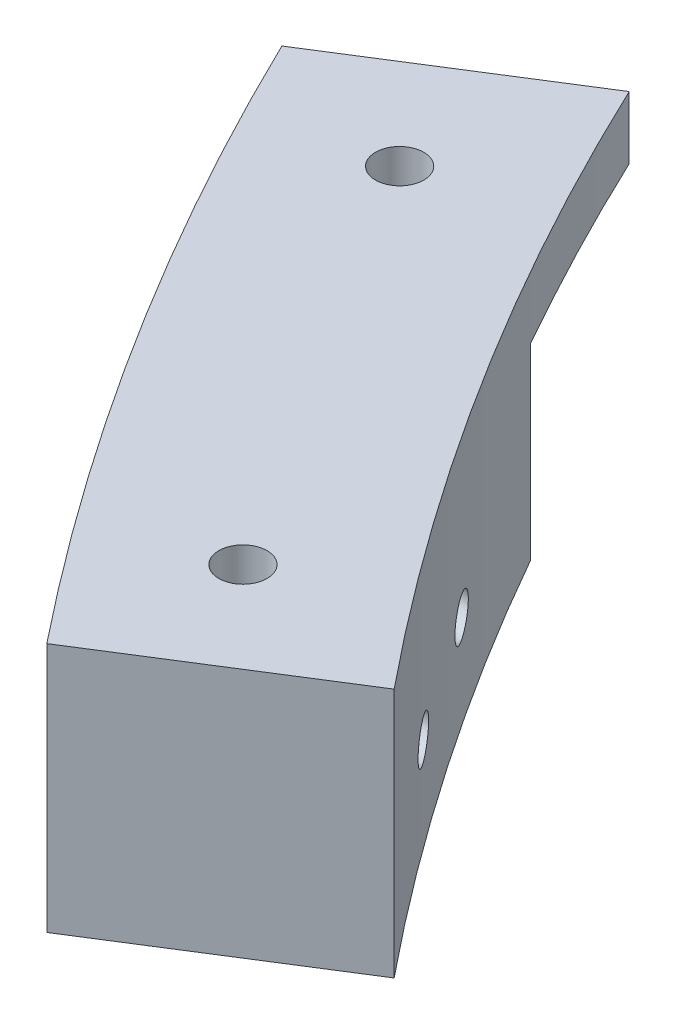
from build123d import *

# Parameters (mm, degrees)
BOSS_EXTRUDE1_DEPTH     = 50.8
CUT_EXTRUDE1_DEPTH      = 38.1
F_3_8_CLEARANCE_HOLE1_D = 9.8044
F_3_8_CLEARANCE_HOLE2_D = 9.8044
F_3_8_16_TAPPED_HOLE1_D = 7.9375
F_3_8_16_TAPPED_HOLE2_D = 7.9375


with BuildPart() as part:
    # Sketch1 → Boss-Extrude1 (new body)
    with BuildSketch(Plane.XZ.offset(80.9625)):
        with BuildLine():
            Line((-617.309061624, 298.749330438), (-574.034978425, 271.493726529))
            ThreePointArc((-574.034978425, 271.493726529), (-537.307692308, 338.416080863), (-492.815119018, 400.447572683))
            Line((-492.815119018, 400.447572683), (-536.089202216, 427.703176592))
            ThreePointArc((-536.089202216, 427.703176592), (-580.292307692, 365.489367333), (-617.309061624, 298.749330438))
        make_face()
    extrude(amount=-BOSS_EXTRUDE1_DEPTH)

    # Sketch2 → Cut-Extrude1 (cut)
    with BuildSketch(Plane.XZ.offset(80.9625)):
        with BuildLine():
            Line((-552.45, 313.087843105), (-552.45, 406.350387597))
            ThreePointArc((-552.45, 406.350387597), (-587.348757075, 354.038243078), (-617.309061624, 298.749330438))
            Line((-617.309061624, 298.749330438), (-574.034978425, 271.493726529))
            ThreePointArc((-574.034978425, 271.493726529), (-563.626311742, 292.489966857), (-552.45, 313.087843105))
        make_face()
    extrude(amount=-CUT_EXTRUDE1_DEPTH, mode=Mode.SUBTRACT)

    # 3_8 Clearance Hole1 (through all)
    with Locations(Plane(origin=(0, -80.9625, 0), x_dir=(-1, 0, 0), z_dir=(0, -1, 0))):
        with Locations((530.071006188, -393.894514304)):
            Hole(F_3_8_CLEARANCE_HOLE1_D / 2)

    # 3_8 Clearance Hole2 (through all)
    with Locations(Plane(origin=(0, -30.1625, 0), x_dir=(1, 0, 0), z_dir=(0, 1, 0))):
        with Locations((-584.217579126, -307.925283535)):
            Hole(F_3_8_CLEARANCE_HOLE2_D / 2)

    # 3_8-16 Tapped Hole1 (through all)
    with Locations(Plane.ZY.offset(552.45)):
        with Locations((374.65, -61.9125)):
            Hole(F_3_8_16_TAPPED_HOLE1_D / 2)

    # 3_8-16 Tapped Hole2 (through all)
    with Locations(Plane.ZY.offset(552.45)):
        with Locations((349.25, -61.9125)):
            Hole(F_3_8_16_TAPPED_HOLE2_D / 2)


solid = part.part
